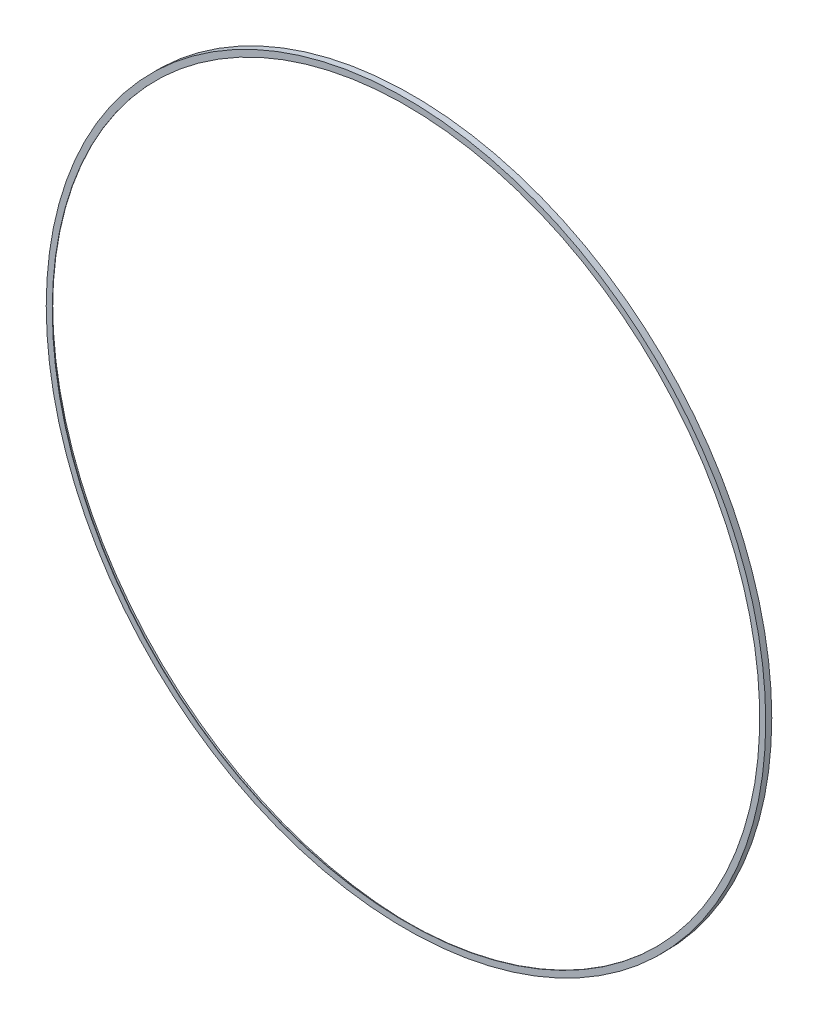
from build123d import *


with BuildPart() as part:
    # Sketch1 → Revolve1 (revolve)
    with BuildSketch(Plane(origin=(0, 0, 0), x_dir=(1, 0, 0), z_dir=(0, 1, 0)), mode=Mode.PRIVATE) as revolve1_sk:
        Polygon((1490.6625, 0), (1516.0625, 0), (1516.0625, 25.4), (1514.475, 25.4), (1514.475, 1.5875), (1490.6625, 1.5875), align=None)
    revolve(revolve1_sk.sketch.rotate(Axis((0, 0, -88.99), (0, 0, 1)), 180), axis=Axis((0, 0, -88.99), (0, 0, 1)))


solid = part.part
